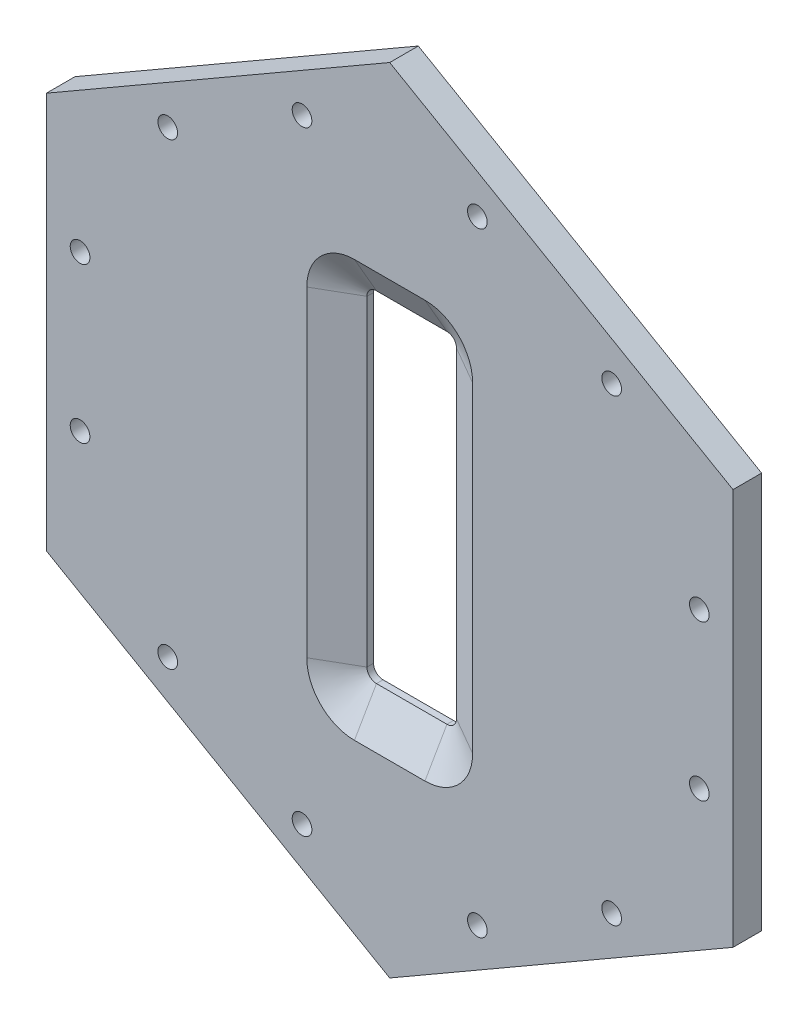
from build123d import *

# Parameters (mm, degrees)
BOSS_EXTRUDE1_DEPTH     = 9.525
CUT_EXTRUDE4_DEPTH      = 350.322151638
CUT_EXTRUDE4_DEPTH_BACK = 350.322151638
SKETCH7_R               = 6.5484375
CUT_EXTRUDE5_DEPTH      = 350.322151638
CUT_EXTRUDE5_DEPTH_BACK = 350.322151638
CHAMFER2_SIZE           = 25.4
CHAMFER2_SIZE2          = 14.664696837


with BuildPart() as part:
    # Sketch1 → Boss-Extrude1 (new, symmetric)
    with BuildSketch(Plane(origin=(0, 0, 0), x_dir=(0, -1, 0), z_dir=(0, 0, 1))):
        Polygon((131.982271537, -228.6), (263.964543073, 0), (131.982271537, 228.6), (-131.982271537, 228.6), (-263.964543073, 0), (-131.982271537, -228.6), align=None)
    extrude(amount=BOSS_EXTRUDE1_DEPTH, both=True)

    # Sketch7 → Cut-Extrude4 (cut, two sides: drawn at the far end of the back side and taken through both)
    with BuildSketch(Plane(origin=(0, 0, 0), x_dir=(0, 1, 0), z_dir=(0, 0, 1)).offset(-CUT_EXTRUDE4_DEPTH_BACK)):
        with Locations(Location((-51.626591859, -206.1765625, 0), (0, 0, 270))):
            Circle(SKETCH7_R)
        with Locations(Location((51.626591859, -206.1765625, 0), (0, 0, 270))):
            Circle(SKETCH7_R)
        with Locations(Location((-204.367436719, -58.37834119, 0), (0, 0, 270))):
            Circle(SKETCH7_R)
        with Locations(Location((-152.740844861, -147.79822131, 0), (0, 0, 270))):
            Circle(SKETCH7_R)
        with Locations(Location((-152.740844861, 147.79822131, 0), (0, 0, 270))):
            Circle(SKETCH7_R)
        with Locations(Location((-204.367436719, 58.37834119, 0), (0, 0, 270))):
            Circle(SKETCH7_R)
        with Locations(Location((51.626591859, 206.1765625, 0), (0, 0, 270))):
            Circle(SKETCH7_R)
        with Locations(Location((-51.626591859, 206.1765625, 0), (0, 0, 270))):
            Circle(SKETCH7_R)
        with Locations(Location((204.367436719, 58.37834119, 0), (0, 0, 270))):
            Circle(SKETCH7_R)
        with Locations(Location((152.740844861, 147.79822131, 0), (0, 0, 270))):
            Circle(SKETCH7_R)
        with Locations(Location((152.740844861, -147.79822131, 0), (0, 0, 270))):
            Circle(SKETCH7_R)
        with Locations(Location((204.367436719, -58.37834119, 0), (0, 0, 270))):
            Circle(SKETCH7_R)
    extrude(amount=CUT_EXTRUDE4_DEPTH + CUT_EXTRUDE4_DEPTH_BACK, mode=Mode.SUBTRACT)

    # Sketch10 → Cut-Extrude5 (cut, two sides: drawn at the far end of the back side and taken through both)
    with BuildSketch(Plane(origin=(0, 0, 0), x_dir=(0, 1, 0), z_dir=(0, 0, 1)).offset(-CUT_EXTRUDE5_DEPTH_BACK)):
        with BuildLine():
            Line((-113.250009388, 23.464999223), (-113.250009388, -23.464999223))
            ThreePointArc((-113.250009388, -23.464999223), (-111.390137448, -27.955127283), (-106.900009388, -29.814999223))
            Line((-106.900009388, -29.814999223), (106.900009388, -29.814999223))
            ThreePointArc((106.900009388, -29.814999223), (111.390137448, -27.955127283), (113.250009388, -23.464999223))
            Line((113.250009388, -23.464999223), (113.250009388, 23.464999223))
            ThreePointArc((113.250009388, 23.464999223), (111.390137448, 27.955127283), (106.900009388, 29.814999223))
            Line((106.900009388, 29.814999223), (-106.900009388, 29.814999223))
            ThreePointArc((-106.900009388, 29.814999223), (-111.390137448, 27.955127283), (-113.250009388, 23.464999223))
        make_face()
    extrude(amount=CUT_EXTRUDE5_DEPTH + CUT_EXTRUDE5_DEPTH_BACK, mode=Mode.SUBTRACT)

    # Chamfer2
    chamfer2_edges = [part.edges().sort_by_distance(p)[0] for p in [
        (-27.955127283, -111.390137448, 9.525),
        (0, -113.250009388, 9.525),
        (27.955127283, -111.390137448, 9.525),
        (29.814999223, 0, 9.525),
        (27.955127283, 111.390137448, 9.525),
        (0, 113.250009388, 9.525),
        (-27.955127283, 111.390137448, 9.525),
        (-29.814999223, 0, 9.525),
    ]]
    chamfer2_side = [part.faces().sort_by_distance(p)[0] for p in [
        (-110.80807732, -191.925219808, 9.525),
    ]]
    chamfer(chamfer2_edges, length=CHAMFER2_SIZE, length2=CHAMFER2_SIZE2, reference=chamfer2_side[0])


solid = part.part
